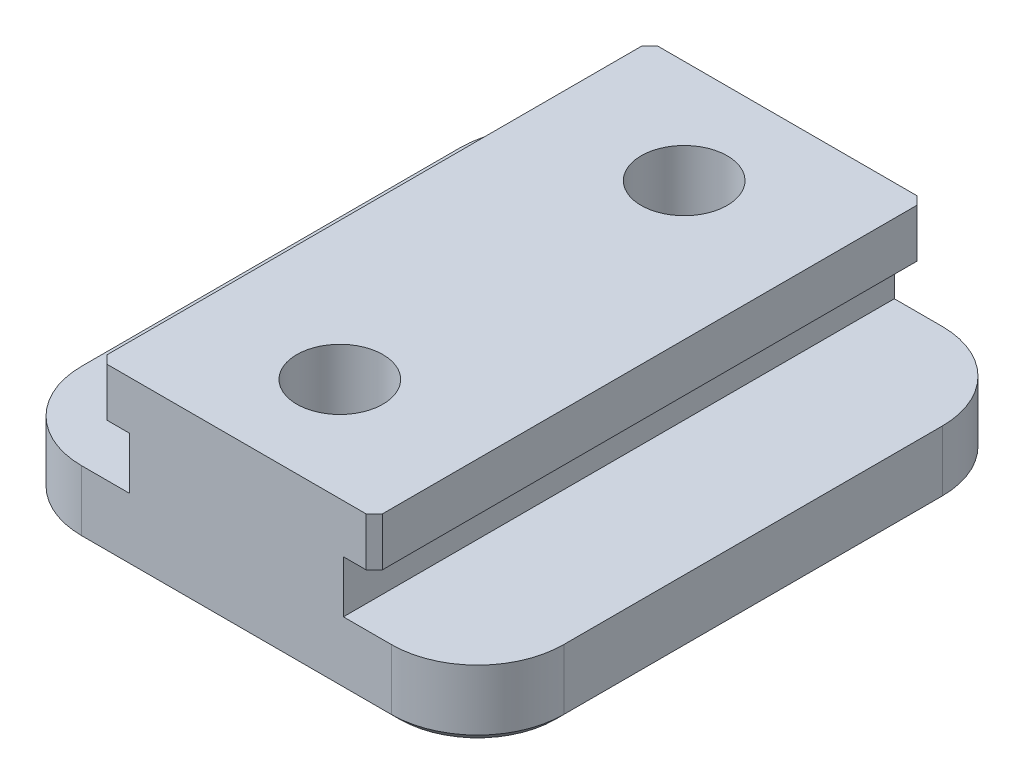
from build123d import *

# Parameters (mm, degrees)
BOSS_EXTRUDE1_DEPTH = 25.4
FILLET1_R           = 7.9502
CHAMFER1_SIZE       = 0.762
CHAMFER3_SIZE       = 0.762
TAPPED_HOLE1_D      = 7.9375


with BuildPart() as part:
    # Sketch1 → Boss-Extrude1 (new, symmetric)
    with BuildSketch(Plane.XY):
        Polygon((12.7, 6.096), (-12.7, 6.096), (-12.7, 1.6256), (-9.8552, 1.6256), (-9.8552, -3.175), (-22.225, -3.175), (-22.225, -9.525), (22.225, -9.525), (22.225, -3.175), (9.8552, -3.175), (9.8552, 1.6256), (12.7, 1.6256), align=None)
    extrude(amount=BOSS_EXTRUDE1_DEPTH, both=True)

    # Fillet1
    fillet1_edges = [part.edges().sort_by_distance(p)[0] for p in [
        (22.225, -6.35, -25.4),
        (-22.225, -6.35, -25.4),
        (-22.225, -6.35, 25.4),
        (22.225, -6.35, 25.4),
    ]]
    fillet(fillet1_edges, radius=FILLET1_R)

    # Chamfer1
    chamfer1_edges = [part.edges().sort_by_distance(p)[0] for p in [
        (0, -9.525, 25.4),
        (0, -9.525, -25.4),
        (22.225, -9.525, 0),
        (-22.225, -9.525, 0),
        (19.896440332, -9.525, 23.071440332),
        (19.896440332, -9.525, -23.071440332),
        (-19.896440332, -9.525, -23.071440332),
        (-19.896440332, -9.525, 23.071440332),
    ]]
    chamfer(chamfer1_edges, length=CHAMFER1_SIZE)

    # Chamfer3
    chamfer3_edges = [part.edges().sort_by_distance(p)[0] for p in [
        (12.7, 3.8608, -25.4),
        (-12.7, 3.8608, -25.4),
        (12.7, 3.8608, 25.4),
        (-12.7, 3.8608, 25.4),
    ]]
    chamfer(chamfer3_edges, length=CHAMFER3_SIZE)

    # Tapped Hole1 (through all)
    with Locations(Plane(origin=(0, -9.525, 0), x_dir=(-1, 0, 0), z_dir=(0, -1, 0))):
        with Locations((0, 15.875)):
            tapped_hole1 = Hole(TAPPED_HOLE1_D / 2)

    # Mirror1: Tapped Hole1 across plane
    add(tapped_hole1.mirror(Plane.XY), mode=Mode.SUBTRACT)


solid = part.part
